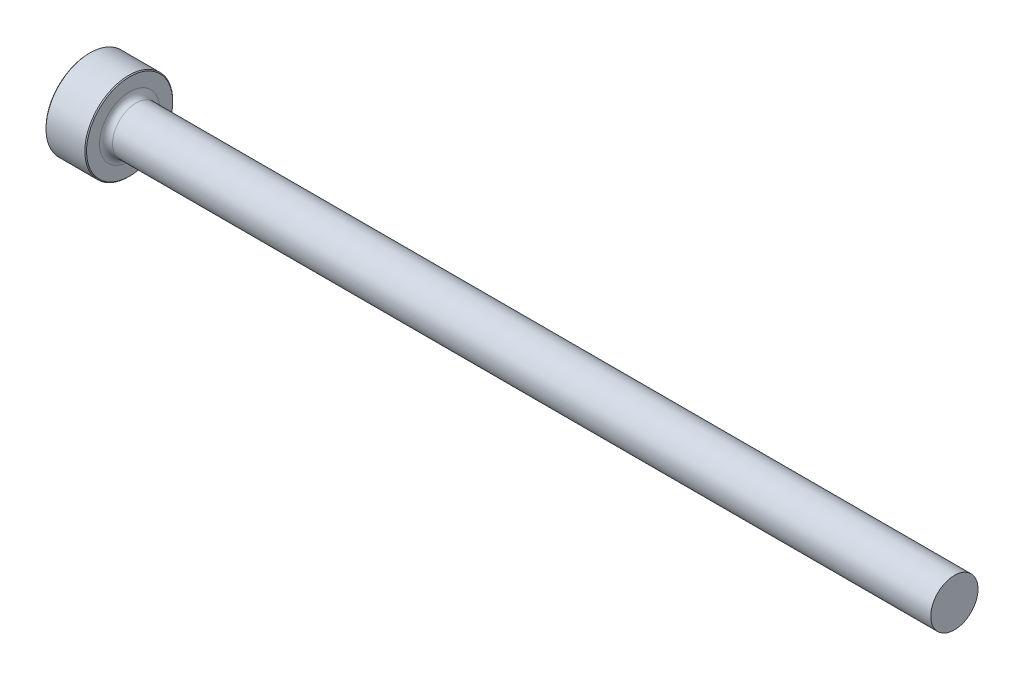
ISO-10303-21;
HEADER;
FILE_DESCRIPTION(('STEP AP214'),'2;1');
FILE_NAME('part.step','',(''),(''),'','','');
FILE_SCHEMA(('AUTOMOTIVE_DESIGN { 1 0 10303 214 1 1 1 1 }'));
ENDSEC;
DATA;
#1=APPLICATION_CONTEXT('core data for automotive mechanical design processes');
#2=APPLICATION_PROTOCOL_DEFINITION('international standard','automotive_design',2000,#1);
#3=PRODUCT_CONTEXT('',#1,'mechanical');
#4=PRODUCT('Part','Part','',(#3));
#5=PRODUCT_RELATED_PRODUCT_CATEGORY('part','',(#4));
#6=PRODUCT_DEFINITION_FORMATION('','',#4);
#7=PRODUCT_DEFINITION_CONTEXT('part definition',#1,'design');
#8=PRODUCT_DEFINITION('design','',#6,#7);
#9=PRODUCT_DEFINITION_SHAPE('','',#8);
#10=(LENGTH_UNIT() NAMED_UNIT(*) SI_UNIT(.MILLI.,.METRE.));
#11=(NAMED_UNIT(*) PLANE_ANGLE_UNIT() SI_UNIT($,.RADIAN.));
#12=(NAMED_UNIT(*) SI_UNIT($,.STERADIAN.) SOLID_ANGLE_UNIT());
#13=UNCERTAINTY_MEASURE_WITH_UNIT(LENGTH_MEASURE(1.E-05),#10,'distance_accuracy_value','');
#14=(GEOMETRIC_REPRESENTATION_CONTEXT(3) GLOBAL_UNCERTAINTY_ASSIGNED_CONTEXT((#13)) GLOBAL_UNIT_ASSIGNED_CONTEXT((#10,
#11,#12)) REPRESENTATION_CONTEXT('',''));
#15=CARTESIAN_POINT('',(0.,0.,0.));
#16=DIRECTION('',(0.,0.,1.));
#17=DIRECTION('',(1.,0.,0.));
#18=AXIS2_PLACEMENT_3D('',#15,#16,#17);
#19=CARTESIAN_POINT('',(101.6,2.77431499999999,0.));
#20=DIRECTION('',(1.,0.,0.));
#21=DIRECTION('',(0.,1.,0.));
#22=AXIS2_PLACEMENT_3D('',#19,#20,#21);
#23=PLANE('',#22);
#24=CARTESIAN_POINT('',(101.6,0.,0.));
#25=DIRECTION('',(1.,0.,0.));
#26=DIRECTION('',(0.,1.,0.));
#27=AXIS2_PLACEMENT_3D('',#24,#25,#26);
#28=CIRCLE('',#27,2.774315);
#29=CARTESIAN_POINT('',(101.6,2.77431499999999,0.));
#30=VERTEX_POINT('',#29);
#31=EDGE_CURVE('E50',#30,#30,#28,.T.);
#32=ORIENTED_EDGE('',*,*,#31,.T.);
#33=EDGE_LOOP('',(#32));
#34=FACE_BOUND('',#33,.T.);
#35=ADVANCED_FACE('F30',(#34),#23,.T.);
#36=CARTESIAN_POINT('',(101.6,0.,0.));
#37=DIRECTION('',(1.,0.,0.));
#38=DIRECTION('',(0.,1.,0.));
#39=AXIS2_PLACEMENT_3D('',#36,#37,#38);
#40=CYLINDRICAL_SURFACE('',#39,2.774315);
#41=CARTESIAN_POINT('',(5.5245,0.,0.));
#42=DIRECTION('',(1.,0.,0.));
#43=DIRECTION('',(0.,1.,0.));
#44=AXIS2_PLACEMENT_3D('',#41,#42,#43);
#45=CIRCLE('',#44,2.77431499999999);
#46=CARTESIAN_POINT('',(5.5245,2.77431499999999,0.));
#47=VERTEX_POINT('',#46);
#48=EDGE_CURVE('E53',#47,#47,#45,.T.);
#49=ORIENTED_EDGE('',*,*,#48,.T.);
#50=EDGE_LOOP('',(#49));
#51=FACE_BOUND('',#50,.T.);
#52=ORIENTED_EDGE('',*,*,#31,.F.);
#53=EDGE_LOOP('',(#52));
#54=FACE_BOUND('',#53,.T.);
#55=ADVANCED_FACE('F74',(#51,#54),#40,.T.);
#56=CARTESIAN_POINT('',(5.5245,0.,0.));
#57=DIRECTION('',(1.,0.,0.));
#58=DIRECTION('',(0.,1.,0.));
#59=AXIS2_PLACEMENT_3D('',#56,#57,#58);
#60=TOROIDAL_SURFACE('',#59,3.53631499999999,0.762);
#61=CARTESIAN_POINT('',(4.7625,0.,0.));
#62=DIRECTION('',(1.,0.,0.));
#63=DIRECTION('',(0.,1.,0.));
#64=AXIS2_PLACEMENT_3D('',#61,#62,#63);
#65=CIRCLE('',#64,3.53631499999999);
#66=CARTESIAN_POINT('',(4.7625,3.53631499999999,0.));
#67=VERTEX_POINT('',#66);
#68=EDGE_CURVE('E56',#67,#67,#65,.T.);
#69=ORIENTED_EDGE('',*,*,#68,.T.);
#70=EDGE_LOOP('',(#69));
#71=FACE_BOUND('',#70,.T.);
#72=ORIENTED_EDGE('',*,*,#48,.F.);
#73=EDGE_LOOP('',(#72));
#74=FACE_BOUND('',#73,.T.);
#75=ADVANCED_FACE('F60',(#71,#74),#60,.F.);
#76=CARTESIAN_POINT('',(4.7625,5.159375,0.));
#77=DIRECTION('',(1.,0.,0.));
#78=DIRECTION('',(0.,1.,0.));
#79=AXIS2_PLACEMENT_3D('',#76,#77,#78);
#80=PLANE('',#79);
#81=CARTESIAN_POINT('',(4.7625,0.,0.));
#82=DIRECTION('',(1.,0.,0.));
#83=DIRECTION('',(0.,1.,0.));
#84=AXIS2_PLACEMENT_3D('',#81,#82,#83);
#85=CIRCLE('',#84,5.05777499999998);
#86=CARTESIAN_POINT('',(4.7625,5.05777499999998,0.));
#87=VERTEX_POINT('',#86);
#88=EDGE_CURVE('E10',#87,#87,#85,.T.);
#89=ORIENTED_EDGE('',*,*,#88,.T.);
#90=EDGE_LOOP('',(#89));
#91=FACE_BOUND('',#90,.T.);
#92=ORIENTED_EDGE('',*,*,#68,.F.);
#93=EDGE_LOOP('',(#92));
#94=FACE_BOUND('',#93,.T.);
#95=ADVANCED_FACE('F63',(#91,#94),#80,.T.);
#96=CARTESIAN_POINT('',(101.6,0.,0.));
#97=DIRECTION('',(1.,0.,0.));
#98=DIRECTION('',(0.,1.,0.));
#99=AXIS2_PLACEMENT_3D('',#96,#97,#98);
#100=CYLINDRICAL_SURFACE('',#99,5.159375);
#101=CARTESIAN_POINT('',(0.101599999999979,0.,0.));
#102=DIRECTION('',(-1.,0.,0.));
#103=DIRECTION('',(0.,-1.,0.));
#104=AXIS2_PLACEMENT_3D('',#101,#102,#103);
#105=CIRCLE('',#104,5.159375);
#106=CARTESIAN_POINT('',(0.101599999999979,-5.159375,0.));
#107=VERTEX_POINT('',#106);
#108=EDGE_CURVE('E41',#107,#107,#105,.F.);
#109=ORIENTED_EDGE('',*,*,#108,.T.);
#110=EDGE_LOOP('',(#109));
#111=FACE_BOUND('',#110,.T.);
#112=CARTESIAN_POINT('',(4.66089999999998,0.,0.));
#113=DIRECTION('',(1.,0.,0.));
#114=DIRECTION('',(0.,1.,0.));
#115=AXIS2_PLACEMENT_3D('',#112,#113,#114);
#116=CIRCLE('',#115,5.159375);
#117=CARTESIAN_POINT('',(4.66089999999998,5.159375,0.));
#118=VERTEX_POINT('',#117);
#119=EDGE_CURVE('E45',#118,#118,#116,.F.);
#120=ORIENTED_EDGE('',*,*,#119,.T.);
#121=EDGE_LOOP('',(#120));
#122=FACE_BOUND('',#121,.T.);
#123=ADVANCED_FACE('F65',(#111,#122),#100,.T.);
#124=CARTESIAN_POINT('',(0.,0.,0.));
#125=DIRECTION('',(-1.,0.,0.));
#126=DIRECTION('',(0.,-1.,0.));
#127=AXIS2_PLACEMENT_3D('',#124,#125,#126);
#128=PLANE('',#127);
#129=CARTESIAN_POINT('',(0.,0.,0.));
#130=DIRECTION('',(-1.,0.,0.));
#131=DIRECTION('',(0.,-1.,0.));
#132=AXIS2_PLACEMENT_3D('',#129,#130,#131);
#133=CIRCLE('',#132,5.05777500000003);
#134=CARTESIAN_POINT('',(0.,-5.05777500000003,0.));
#135=VERTEX_POINT('',#134);
#136=EDGE_CURVE('E37',#135,#135,#133,.T.);
#137=ORIENTED_EDGE('',*,*,#136,.T.);
#138=EDGE_LOOP('',(#137));
#139=FACE_BOUND('',#138,.T.);
#140=ADVANCED_FACE('F71',(#139),#128,.T.);
#141=CARTESIAN_POINT('',(0.101599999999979,0.,0.));
#142=DIRECTION('',(1.,0.,0.));
#143=DIRECTION('',(0.,1.,0.));
#144=AXIS2_PLACEMENT_3D('',#141,#142,#143);
#145=CONICAL_SURFACE('',#144,5.159375,0.78539816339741);
#146=ORIENTED_EDGE('',*,*,#136,.F.);
#147=EDGE_LOOP('',(#146));
#148=FACE_BOUND('',#147,.T.);
#149=ORIENTED_EDGE('',*,*,#108,.F.);
#150=EDGE_LOOP('',(#149));
#151=FACE_BOUND('',#150,.T.);
#152=ADVANCED_FACE('F84',(#148,#151),#145,.T.);
#153=CARTESIAN_POINT('',(4.7625,0.,0.));
#154=DIRECTION('',(-1.,0.,0.));
#155=DIRECTION('',(0.,-1.,0.));
#156=AXIS2_PLACEMENT_3D('',#153,#154,#155);
#157=CONICAL_SURFACE('',#156,5.05777499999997,0.785398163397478);
#158=ORIENTED_EDGE('',*,*,#119,.F.);
#159=EDGE_LOOP('',(#158));
#160=FACE_BOUND('',#159,.T.);
#161=ORIENTED_EDGE('',*,*,#88,.F.);
#162=EDGE_LOOP('',(#161));
#163=FACE_BOUND('',#162,.T.);
#164=ADVANCED_FACE('F32',(#160,#163),#157,.T.);
#165=CLOSED_SHELL('',(#35,#55,#75,#95,#123,#140,#152,#164));
#166=MANIFOLD_SOLID_BREP('B2',#165);
#167=ADVANCED_BREP_SHAPE_REPRESENTATION('',(#18,#166),#14);
#168=SHAPE_DEFINITION_REPRESENTATION(#9,#167);
ENDSEC;
END-ISO-10303-21;
